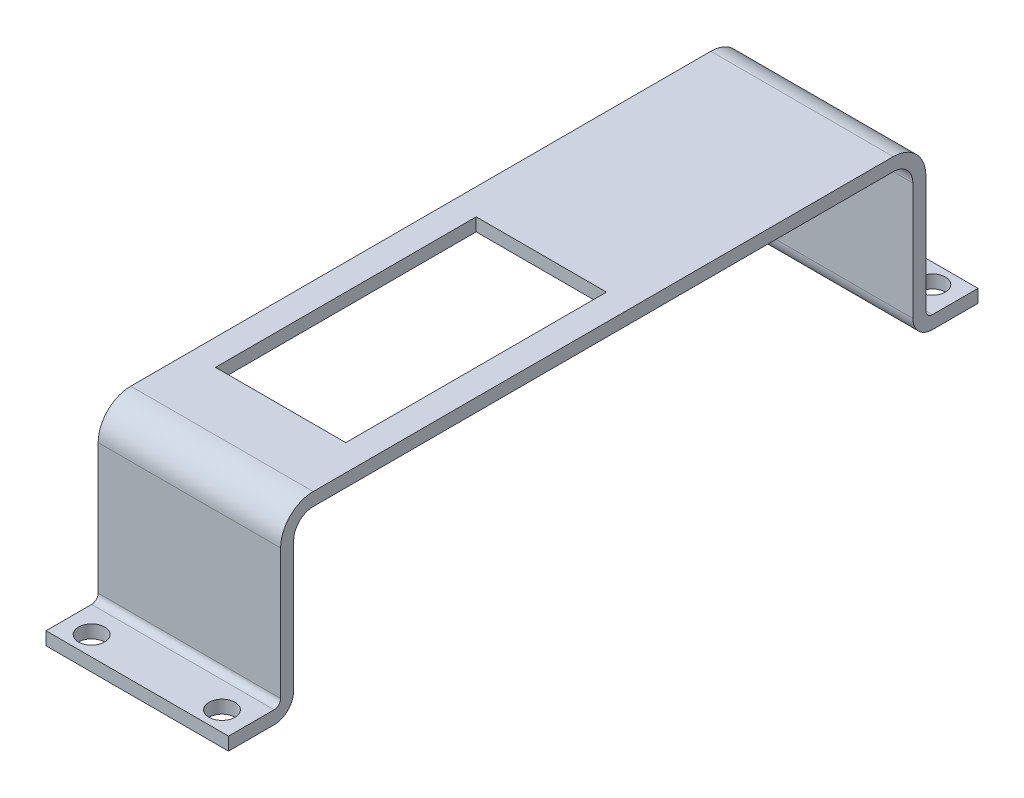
from build123d import *

# Parameters (mm, degrees)
BOSS_EXTRUDE1_DEPTH = 14
SKETCH2_W           = 20
SKETCH2_H           = 40
CUT_EXTRUDE1_DEPTH  = 110.567330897
SKETCH3_R           = 2
CUT_EXTRUDE2_DEPTH  = 110.073369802
SKETCH4_R           = 2
CUT_EXTRUDE3_DEPTH  = 109.613995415


with BuildPart() as part:
    # Sketch1 → Boss-Extrude1 (new, symmetric)
    with BuildSketch(Plane(origin=(0, 0, 0), x_dir=(0, 0, -1), z_dir=(1, 0, 0))):
        with BuildLine():
            Line((3, 0), (10, 0))
            Line((10, 0), (10, 2))
            Line((10, 2), (3, 2))
            ThreePointArc((3, 2), (2.292893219, 2.292893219), (2, 3))
            Line((2, 3), (2, 21))
            ThreePointArc((2, 21), (0.535533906, 24.535533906), (-3, 26))
            Line((-3, 26), (-92, 26))
            ThreePointArc((-92, 26), (-95.535533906, 24.535533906), (-97, 21))
            Line((-97, 21), (-97, 1))
            ThreePointArc((-97, 1), (-97.292893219, 0.292893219), (-98, 0))
            Line((-98, 0), (-105, 0))
            Line((-105, 0), (-105, -2))
            Line((-105, -2), (-98, -2))
            ThreePointArc((-98, -2), (-95.878679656, -1.121320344), (-95, 1))
            Line((-95, 1), (-95, 21))
            ThreePointArc((-95, 21), (-94.121320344, 23.121320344), (-92, 24))
            Line((-92, 24), (-3, 24))
            ThreePointArc((-3, 24), (-0.878679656, 23.121320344), (0, 21))
            Line((0, 21), (0, 3))
            ThreePointArc((0, 3), (0.878679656, 0.878679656), (3, 0))
        make_face()
    extrude(amount=BOSS_EXTRUDE1_DEPTH, both=True)

    # Sketch2 → Cut-Extrude1 (cut, through all)
    with BuildSketch(Plane(origin=(0, 26, 0), x_dir=(1, 0, 0), z_dir=(0, 1, 0))):
        with Locations((0, -63)):
            Rectangle(SKETCH2_W, SKETCH2_H)
    extrude(amount=-CUT_EXTRUDE1_DEPTH, mode=Mode.SUBTRACT)

    # Sketch3 → Cut-Extrude2 (cut, through all)
    with BuildSketch(Plane(origin=(0, 0, 0), x_dir=(1, 0, 0), z_dir=(0, 1, 0))):
        with Locations(Location((10, -102, 0), (0, 0, 270))):
            Circle(SKETCH3_R)
        with Locations(Location((-10, -102, 0), (0, 0, 270))):
            Circle(SKETCH3_R)
    extrude(amount=-CUT_EXTRUDE2_DEPTH, mode=Mode.SUBTRACT)

    # Sketch4 → Cut-Extrude3 (cut, through all)
    with BuildSketch(Plane(origin=(0, 2, 0), x_dir=(1, 0, 0), z_dir=(0, 1, 0))):
        with Locations(Location((10, 7, 0), (0, 0, 270))):
            Circle(SKETCH4_R)
        with Locations(Location((-10, 7, 0), (0, 0, 270))):
            Circle(SKETCH4_R)
    extrude(amount=-CUT_EXTRUDE3_DEPTH, mode=Mode.SUBTRACT)


solid = part.part
